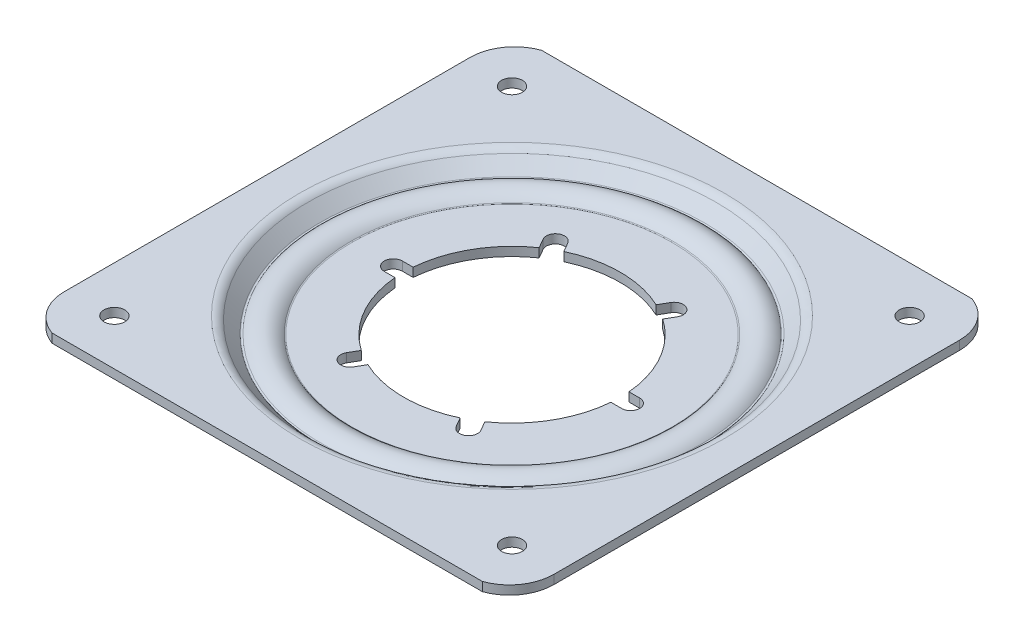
ISO-10303-21;
HEADER;
FILE_DESCRIPTION(('STEP AP214'),'2;1');
FILE_NAME('part.step','',(''),(''),'','','');
FILE_SCHEMA(('AUTOMOTIVE_DESIGN { 1 0 10303 214 1 1 1 1 }'));
ENDSEC;
DATA;
#1=APPLICATION_CONTEXT('core data for automotive mechanical design processes');
#2=APPLICATION_PROTOCOL_DEFINITION('international standard','automotive_design',2000,#1);
#3=PRODUCT_CONTEXT('',#1,'mechanical');
#4=PRODUCT('Part','Part','',(#3));
#5=PRODUCT_RELATED_PRODUCT_CATEGORY('part','',(#4));
#6=PRODUCT_DEFINITION_FORMATION('','',#4);
#7=PRODUCT_DEFINITION_CONTEXT('part definition',#1,'design');
#8=PRODUCT_DEFINITION('design','',#6,#7);
#9=PRODUCT_DEFINITION_SHAPE('','',#8);
#10=(LENGTH_UNIT() NAMED_UNIT(*) SI_UNIT(.MILLI.,.METRE.));
#11=(NAMED_UNIT(*) PLANE_ANGLE_UNIT() SI_UNIT($,.RADIAN.));
#12=(NAMED_UNIT(*) SI_UNIT($,.STERADIAN.) SOLID_ANGLE_UNIT());
#13=UNCERTAINTY_MEASURE_WITH_UNIT(LENGTH_MEASURE(1.E-05),#10,'distance_accuracy_value','');
#14=(GEOMETRIC_REPRESENTATION_CONTEXT(3) GLOBAL_UNCERTAINTY_ASSIGNED_CONTEXT((#13)) GLOBAL_UNIT_ASSIGNED_CONTEXT((#10,
#11,#12)) REPRESENTATION_CONTEXT('',''));
#15=CARTESIAN_POINT('',(0.,0.,0.));
#16=DIRECTION('',(0.,0.,1.));
#17=DIRECTION('',(1.,0.,0.));
#18=AXIS2_PLACEMENT_3D('',#15,#16,#17);
#19=CARTESIAN_POINT('',(-23.0389525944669,5.60000000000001,3.04999999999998));
#20=DIRECTION('',(0.,0.,1.));
#21=DIRECTION('',(-1.,0.,0.));
#22=AXIS2_PLACEMENT_3D('',#19,#20,#21);
#23=PLANE('',#22);
#24=DIRECTION('',(0.,1.,0.));
#25=VECTOR('',#24,1.);
#26=CARTESIAN_POINT('',(-36.3723452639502,8.60000000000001,3.04999999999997));
#27=LINE('',#26,#25);
#28=CARTESIAN_POINT('',(-36.3723452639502,13.1,3.04999999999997));
#29=VERTEX_POINT('',#28);
#30=CARTESIAN_POINT('',(-36.3723452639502,10.1,3.04999999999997));
#31=VERTEX_POINT('',#30);
#32=EDGE_CURVE('E243',#29,#31,#27,.F.);
#33=ORIENTED_EDGE('',*,*,#32,.T.);
#34=DIRECTION('',(-1.,0.,0.));
#35=VECTOR('',#34,1.);
#36=CARTESIAN_POINT('',(0.,10.1,3.04999999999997));
#37=LINE('',#36,#35);
#38=CARTESIAN_POINT('',(-40.,10.1,3.04999999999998));
#39=VERTEX_POINT('',#38);
#40=EDGE_CURVE('E273',#39,#31,#37,.F.);
#41=ORIENTED_EDGE('',*,*,#40,.F.);
#42=DIRECTION('',(0.,1.,0.));
#43=VECTOR('',#42,1.);
#44=CARTESIAN_POINT('',(-40.,5.60000000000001,3.04999999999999));
#45=LINE('',#44,#43);
#46=CARTESIAN_POINT('',(-40.,13.1,3.04999999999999));
#47=VERTEX_POINT('',#46);
#48=EDGE_CURVE('E651',#39,#47,#45,.T.);
#49=ORIENTED_EDGE('',*,*,#48,.T.);
#50=DIRECTION('',(-1.,0.,0.));
#51=VECTOR('',#50,1.);
#52=CARTESIAN_POINT('',(0.,13.1,3.04999999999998));
#53=LINE('',#52,#51);
#54=EDGE_CURVE('E525',#29,#47,#53,.T.);
#55=ORIENTED_EDGE('',*,*,#54,.F.);
#56=EDGE_LOOP('',(#33,#41,#49,#55));
#57=FACE_BOUND('',#56,.T.);
#58=ADVANCED_FACE('F15',(#57),#23,.F.);
#59=CARTESIAN_POINT('',(-40.,5.60000000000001,0.));
#60=DIRECTION('',(0.,1.,0.));
#61=DIRECTION('',(0.,0.,-1.));
#62=AXIS2_PLACEMENT_3D('',#59,#60,#61);
#63=CYLINDRICAL_SURFACE('',#62,3.05);
#64=ORIENTED_EDGE('',*,*,#48,.F.);
#65=CARTESIAN_POINT('',(-40.,10.1,0.));
#66=DIRECTION('',(0.,1.,0.));
#67=DIRECTION('',(0.,0.,-1.));
#68=AXIS2_PLACEMENT_3D('',#65,#66,#67);
#69=CIRCLE('',#68,3.05);
#70=CARTESIAN_POINT('',(-40.,10.1,-3.05000000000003));
#71=VERTEX_POINT('',#70);
#72=EDGE_CURVE('E528',#71,#39,#69,.T.);
#73=ORIENTED_EDGE('',*,*,#72,.F.);
#74=DIRECTION('',(0.,-1.,0.));
#75=VECTOR('',#74,1.);
#76=CARTESIAN_POINT('',(-40.,5.60000000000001,-3.05000000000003));
#77=LINE('',#76,#75);
#78=CARTESIAN_POINT('',(-40.,13.1,-3.05000000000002));
#79=VERTEX_POINT('',#78);
#80=EDGE_CURVE('E649',#71,#79,#77,.F.);
#81=ORIENTED_EDGE('',*,*,#80,.T.);
#82=CARTESIAN_POINT('',(-40.,13.1,0.));
#83=DIRECTION('',(0.,1.,0.));
#84=DIRECTION('',(0.,0.,-1.));
#85=AXIS2_PLACEMENT_3D('',#82,#83,#84);
#86=CIRCLE('',#85,3.05);
#87=EDGE_CURVE('E524',#47,#79,#86,.F.);
#88=ORIENTED_EDGE('',*,*,#87,.F.);
#89=EDGE_LOOP('',(#64,#73,#81,#88));
#90=FACE_BOUND('',#89,.T.);
#91=ADVANCED_FACE('F808',(#90),#63,.F.);
#92=CARTESIAN_POINT('',(-40.,5.60000000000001,-3.05000000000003));
#93=DIRECTION('',(0.,0.,-1.));
#94=DIRECTION('',(1.,0.,0.));
#95=AXIS2_PLACEMENT_3D('',#92,#93,#94);
#96=PLANE('',#95);
#97=ORIENTED_EDGE('',*,*,#80,.F.);
#98=DIRECTION('',(-1.,0.,0.));
#99=VECTOR('',#98,1.);
#100=CARTESIAN_POINT('',(0.,10.1,-3.05000000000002));
#101=LINE('',#100,#99);
#102=CARTESIAN_POINT('',(-36.3723452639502,10.1,-3.05000000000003));
#103=VERTEX_POINT('',#102);
#104=EDGE_CURVE('E553',#103,#71,#101,.T.);
#105=ORIENTED_EDGE('',*,*,#104,.F.);
#106=DIRECTION('',(0.,1.,0.));
#107=VECTOR('',#106,1.);
#108=CARTESIAN_POINT('',(-36.3723452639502,8.60000000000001,-3.05000000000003));
#109=LINE('',#108,#107);
#110=CARTESIAN_POINT('',(-36.3723452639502,13.1,-3.05000000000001));
#111=VERTEX_POINT('',#110);
#112=EDGE_CURVE('E647',#103,#111,#109,.T.);
#113=ORIENTED_EDGE('',*,*,#112,.T.);
#114=DIRECTION('',(-1.,0.,0.));
#115=VECTOR('',#114,1.);
#116=CARTESIAN_POINT('',(0.,13.1,-3.05));
#117=LINE('',#116,#115);
#118=EDGE_CURVE('E521',#79,#111,#117,.F.);
#119=ORIENTED_EDGE('',*,*,#118,.F.);
#120=EDGE_LOOP('',(#97,#105,#113,#119));
#121=FACE_BOUND('',#120,.T.);
#122=ADVANCED_FACE('F804',(#121),#96,.F.);
#123=CARTESIAN_POINT('',(0.,8.60000000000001,0.));
#124=DIRECTION('',(0.,1.,0.));
#125=DIRECTION('',(0.,0.,-1.));
#126=AXIS2_PLACEMENT_3D('',#123,#124,#125);
#127=CYLINDRICAL_SURFACE('',#126,36.5);
#128=ORIENTED_EDGE('',*,*,#112,.F.);
#129=CARTESIAN_POINT('',(0.,10.1,0.));
#130=DIRECTION('',(0.,1.,0.));
#131=DIRECTION('',(0.,0.,-1.));
#132=AXIS2_PLACEMENT_3D('',#129,#130,#131);
#133=CIRCLE('',#132,36.5);
#134=CARTESIAN_POINT('',(-20.8275501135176,10.1,-29.9743749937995));
#135=VERTEX_POINT('',#134);
#136=EDGE_CURVE('E560',#135,#103,#133,.T.);
#137=ORIENTED_EDGE('',*,*,#136,.F.);
#138=DIRECTION('',(0.,-1.,0.));
#139=VECTOR('',#138,1.);
#140=CARTESIAN_POINT('',(-20.8275501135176,5.60000000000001,-29.9743749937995));
#141=LINE('',#140,#139);
#142=CARTESIAN_POINT('',(-20.8275501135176,13.1,-29.9743749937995));
#143=VERTEX_POINT('',#142);
#144=EDGE_CURVE('E645',#135,#143,#141,.F.);
#145=ORIENTED_EDGE('',*,*,#144,.T.);
#146=CARTESIAN_POINT('',(0.,13.1,0.));
#147=DIRECTION('',(0.,1.,0.));
#148=DIRECTION('',(0.,0.,-1.));
#149=AXIS2_PLACEMENT_3D('',#146,#147,#148);
#150=CIRCLE('',#149,36.5);
#151=EDGE_CURVE('E520',#111,#143,#150,.F.);
#152=ORIENTED_EDGE('',*,*,#151,.F.);
#153=EDGE_LOOP('',(#128,#137,#145,#152));
#154=FACE_BOUND('',#153,.T.);
#155=ADVANCED_FACE('F800',(#154),#127,.F.);
#156=CARTESIAN_POINT('',(-14.160853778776,5.60000000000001,-18.4273182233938));
#157=DIRECTION('',(-0.866025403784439,0.,0.499999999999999));
#158=DIRECTION('',(-0.499999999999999,0.,-0.866025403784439));
#159=AXIS2_PLACEMENT_3D('',#156,#157,#158);
#160=PLANE('',#159);
#161=ORIENTED_EDGE('',*,*,#144,.F.);
#162=DIRECTION('',(0.499999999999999,0.,0.866025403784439));
#163=VECTOR('',#162,1.);
#164=CARTESIAN_POINT('',(-22.6413774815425,10.1,-33.1160161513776));
#165=LINE('',#164,#163);
#166=CARTESIAN_POINT('',(-22.6413774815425,10.1,-33.1160161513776));
#167=VERTEX_POINT('',#166);
#168=EDGE_CURVE('E561',#167,#135,#165,.T.);
#169=ORIENTED_EDGE('',*,*,#168,.F.);
#170=DIRECTION('',(0.,1.,0.));
#171=VECTOR('',#170,1.);
#172=CARTESIAN_POINT('',(-22.6413774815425,5.60000000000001,-33.1160161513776));
#173=LINE('',#172,#171);
#174=CARTESIAN_POINT('',(-22.6413774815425,13.1,-33.1160161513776));
#175=VERTEX_POINT('',#174);
#176=EDGE_CURVE('E642',#167,#175,#173,.T.);
#177=ORIENTED_EDGE('',*,*,#176,.T.);
#178=DIRECTION('',(-0.499999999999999,0.,-0.866025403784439));
#179=VECTOR('',#178,1.);
#180=CARTESIAN_POINT('',(-20.8275501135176,13.1,-29.9743749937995));
#181=LINE('',#180,#179);
#182=EDGE_CURVE('E517',#143,#175,#181,.T.);
#183=ORIENTED_EDGE('',*,*,#182,.F.);
#184=EDGE_LOOP('',(#161,#169,#177,#183));
#185=FACE_BOUND('',#184,.T.);
#186=ADVANCED_FACE('F796',(#185),#160,.F.);
#187=CARTESIAN_POINT('',(-20.,5.60000000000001,-34.6410161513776));
#188=DIRECTION('',(0.,1.,0.));
#189=DIRECTION('',(0.,0.,-1.));
#190=AXIS2_PLACEMENT_3D('',#187,#188,#189);
#191=CYLINDRICAL_SURFACE('',#190,3.05);
#192=CARTESIAN_POINT('',(-20.,10.1,-34.6410161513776));
#193=DIRECTION('',(0.,1.,0.));
#194=DIRECTION('',(0.,0.,-1.));
#195=AXIS2_PLACEMENT_3D('',#192,#193,#194);
#196=CIRCLE('',#195,3.05);
#197=CARTESIAN_POINT('',(-17.3586225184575,10.1,-36.1660161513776));
#198=VERTEX_POINT('',#197);
#199=EDGE_CURVE('E564',#198,#167,#196,.T.);
#200=ORIENTED_EDGE('',*,*,#199,.F.);
#201=DIRECTION('',(0.,-1.,0.));
#202=VECTOR('',#201,1.);
#203=CARTESIAN_POINT('',(-17.3586225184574,5.60000000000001,-36.1660161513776));
#204=LINE('',#203,#202);
#205=CARTESIAN_POINT('',(-17.3586225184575,13.1,-36.1660161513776));
#206=VERTEX_POINT('',#205);
#207=EDGE_CURVE('E640',#198,#206,#204,.F.);
#208=ORIENTED_EDGE('',*,*,#207,.T.);
#209=CARTESIAN_POINT('',(-20.,13.1,-34.6410161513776));
#210=DIRECTION('',(0.,1.,0.));
#211=DIRECTION('',(0.,0.,-1.));
#212=AXIS2_PLACEMENT_3D('',#209,#210,#211);
#213=CIRCLE('',#212,3.05);
#214=EDGE_CURVE('E516',#175,#206,#213,.F.);
#215=ORIENTED_EDGE('',*,*,#214,.F.);
#216=ORIENTED_EDGE('',*,*,#176,.F.);
#217=EDGE_LOOP('',(#200,#208,#215,#216));
#218=FACE_BOUND('',#217,.T.);
#219=ADVANCED_FACE('F792',(#218),#191,.F.);
#220=CARTESIAN_POINT('',(-17.3586225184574,5.60000000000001,-36.1660161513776));
#221=DIRECTION('',(0.866025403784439,0.,-0.5));
#222=DIRECTION('',(0.5,0.,0.866025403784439));
#223=AXIS2_PLACEMENT_3D('',#220,#221,#222);
#224=PLANE('',#223);
#225=ORIENTED_EDGE('',*,*,#207,.F.);
#226=DIRECTION('',(-0.500000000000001,0.,-0.866025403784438));
#227=VECTOR('',#226,1.);
#228=CARTESIAN_POINT('',(-15.5447951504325,10.1,-33.0243749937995));
#229=LINE('',#228,#227);
#230=CARTESIAN_POINT('',(-15.5447951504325,10.1,-33.0243749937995));
#231=VERTEX_POINT('',#230);
#232=EDGE_CURVE('E565',#231,#198,#229,.T.);
#233=ORIENTED_EDGE('',*,*,#232,.F.);
#234=DIRECTION('',(0.,1.,0.));
#235=VECTOR('',#234,1.);
#236=CARTESIAN_POINT('',(-15.5447951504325,8.60000000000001,-33.0243749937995));
#237=LINE('',#236,#235);
#238=CARTESIAN_POINT('',(-15.5447951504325,13.1,-33.0243749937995));
#239=VERTEX_POINT('',#238);
#240=EDGE_CURVE('E637',#231,#239,#237,.T.);
#241=ORIENTED_EDGE('',*,*,#240,.T.);
#242=DIRECTION('',(0.500000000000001,0.,0.866025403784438));
#243=VECTOR('',#242,1.);
#244=CARTESIAN_POINT('',(-17.3586225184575,13.1,-36.1660161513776));
#245=LINE('',#244,#243);
#246=EDGE_CURVE('E513',#206,#239,#245,.T.);
#247=ORIENTED_EDGE('',*,*,#246,.F.);
#248=EDGE_LOOP('',(#225,#233,#241,#247));
#249=FACE_BOUND('',#248,.T.);
#250=ADVANCED_FACE('F790',(#249),#224,.F.);
#251=CARTESIAN_POINT('',(0.,8.60000000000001,0.));
#252=DIRECTION('',(0.,1.,0.));
#253=DIRECTION('',(0.,0.,-1.));
#254=AXIS2_PLACEMENT_3D('',#251,#252,#253);
#255=CYLINDRICAL_SURFACE('',#254,36.5);
#256=CARTESIAN_POINT('',(0.,10.1,0.));
#257=DIRECTION('',(0.,1.,0.));
#258=DIRECTION('',(0.,0.,-1.));
#259=AXIS2_PLACEMENT_3D('',#256,#257,#258);
#260=CIRCLE('',#259,36.5);
#261=CARTESIAN_POINT('',(15.5447951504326,10.1,-33.0243749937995));
#262=VERTEX_POINT('',#261);
#263=EDGE_CURVE('E568',#262,#231,#260,.T.);
#264=ORIENTED_EDGE('',*,*,#263,.F.);
#265=DIRECTION('',(0.,-1.,0.));
#266=VECTOR('',#265,1.);
#267=CARTESIAN_POINT('',(15.5447951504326,5.60000000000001,-33.0243749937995));
#268=LINE('',#267,#266);
#269=CARTESIAN_POINT('',(15.5447951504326,13.1,-33.0243749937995));
#270=VERTEX_POINT('',#269);
#271=EDGE_CURVE('E635',#262,#270,#268,.F.);
#272=ORIENTED_EDGE('',*,*,#271,.T.);
#273=CARTESIAN_POINT('',(0.,13.1,0.));
#274=DIRECTION('',(0.,1.,0.));
#275=DIRECTION('',(0.,0.,-1.));
#276=AXIS2_PLACEMENT_3D('',#273,#274,#275);
#277=CIRCLE('',#276,36.5);
#278=EDGE_CURVE('E512',#239,#270,#277,.F.);
#279=ORIENTED_EDGE('',*,*,#278,.F.);
#280=ORIENTED_EDGE('',*,*,#240,.F.);
#281=EDGE_LOOP('',(#264,#272,#279,#280));
#282=FACE_BOUND('',#281,.T.);
#283=ADVANCED_FACE('F786',(#282),#255,.F.);
#284=CARTESIAN_POINT('',(8.87809881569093,5.60000000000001,-21.4773182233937));
#285=DIRECTION('',(-0.866025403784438,0.,-0.500000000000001));
#286=DIRECTION('',(0.500000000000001,0.,-0.866025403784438));
#287=AXIS2_PLACEMENT_3D('',#284,#285,#286);
#288=PLANE('',#287);
#289=ORIENTED_EDGE('',*,*,#271,.F.);
#290=DIRECTION('',(-0.5,0.,0.866025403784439));
#291=VECTOR('',#290,1.);
#292=CARTESIAN_POINT('',(17.3586225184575,10.1,-36.1660161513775));
#293=LINE('',#292,#291);
#294=CARTESIAN_POINT('',(17.3586225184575,10.1,-36.1660161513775));
#295=VERTEX_POINT('',#294);
#296=EDGE_CURVE('E569',#295,#262,#293,.T.);
#297=ORIENTED_EDGE('',*,*,#296,.F.);
#298=DIRECTION('',(0.,1.,0.));
#299=VECTOR('',#298,1.);
#300=CARTESIAN_POINT('',(17.3586225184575,5.60000000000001,-36.1660161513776));
#301=LINE('',#300,#299);
#302=CARTESIAN_POINT('',(17.3586225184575,13.1,-36.1660161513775));
#303=VERTEX_POINT('',#302);
#304=EDGE_CURVE('E632',#295,#303,#301,.T.);
#305=ORIENTED_EDGE('',*,*,#304,.T.);
#306=DIRECTION('',(0.5,0.,-0.866025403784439));
#307=VECTOR('',#306,1.);
#308=CARTESIAN_POINT('',(15.5447951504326,13.1,-33.0243749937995));
#309=LINE('',#308,#307);
#310=EDGE_CURVE('E509',#270,#303,#309,.T.);
#311=ORIENTED_EDGE('',*,*,#310,.F.);
#312=EDGE_LOOP('',(#289,#297,#305,#311));
#313=FACE_BOUND('',#312,.T.);
#314=ADVANCED_FACE('F783',(#313),#288,.F.);
#315=CARTESIAN_POINT('',(20.,5.60000000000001,-34.6410161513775));
#316=DIRECTION('',(0.,1.,0.));
#317=DIRECTION('',(0.,0.,-1.));
#318=AXIS2_PLACEMENT_3D('',#315,#316,#317);
#319=CYLINDRICAL_SURFACE('',#318,3.05);
#320=CARTESIAN_POINT('',(20.,10.1,-34.6410161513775));
#321=DIRECTION('',(0.,1.,0.));
#322=DIRECTION('',(0.,0.,-1.));
#323=AXIS2_PLACEMENT_3D('',#320,#321,#322);
#324=CIRCLE('',#323,3.05);
#325=CARTESIAN_POINT('',(22.6413774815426,10.1,-33.1160161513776));
#326=VERTEX_POINT('',#325);
#327=EDGE_CURVE('E572',#326,#295,#324,.T.);
#328=ORIENTED_EDGE('',*,*,#327,.F.);
#329=DIRECTION('',(0.,-1.,0.));
#330=VECTOR('',#329,1.);
#331=CARTESIAN_POINT('',(22.6413774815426,5.60000000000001,-33.1160161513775));
#332=LINE('',#331,#330);
#333=CARTESIAN_POINT('',(22.6413774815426,13.1,-33.1160161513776));
#334=VERTEX_POINT('',#333);
#335=EDGE_CURVE('E630',#326,#334,#332,.F.);
#336=ORIENTED_EDGE('',*,*,#335,.T.);
#337=CARTESIAN_POINT('',(20.,13.1,-34.6410161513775));
#338=DIRECTION('',(0.,1.,0.));
#339=DIRECTION('',(0.,0.,-1.));
#340=AXIS2_PLACEMENT_3D('',#337,#338,#339);
#341=CIRCLE('',#340,3.05);
#342=EDGE_CURVE('E508',#303,#334,#341,.F.);
#343=ORIENTED_EDGE('',*,*,#342,.F.);
#344=ORIENTED_EDGE('',*,*,#304,.F.);
#345=EDGE_LOOP('',(#328,#336,#343,#344));
#346=FACE_BOUND('',#345,.T.);
#347=ADVANCED_FACE('F778',(#346),#319,.F.);
#348=CARTESIAN_POINT('',(22.6413774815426,5.60000000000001,-33.1160161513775));
#349=DIRECTION('',(0.866025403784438,0.,0.5));
#350=DIRECTION('',(-0.5,0.,0.866025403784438));
#351=AXIS2_PLACEMENT_3D('',#348,#349,#350);
#352=PLANE('',#351);
#353=ORIENTED_EDGE('',*,*,#335,.F.);
#354=DIRECTION('',(0.499999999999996,0.,-0.866025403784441));
#355=VECTOR('',#354,1.);
#356=CARTESIAN_POINT('',(20.8275501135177,10.1,-29.9743749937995));
#357=LINE('',#356,#355);
#358=CARTESIAN_POINT('',(20.8275501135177,10.1,-29.9743749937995));
#359=VERTEX_POINT('',#358);
#360=EDGE_CURVE('E573',#359,#326,#357,.T.);
#361=ORIENTED_EDGE('',*,*,#360,.F.);
#362=DIRECTION('',(0.,1.,0.));
#363=VECTOR('',#362,1.);
#364=CARTESIAN_POINT('',(20.8275501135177,8.60000000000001,-29.9743749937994));
#365=LINE('',#364,#363);
#366=CARTESIAN_POINT('',(20.8275501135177,13.1,-29.9743749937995));
#367=VERTEX_POINT('',#366);
#368=EDGE_CURVE('E628',#359,#367,#365,.T.);
#369=ORIENTED_EDGE('',*,*,#368,.T.);
#370=DIRECTION('',(-0.499999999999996,0.,0.866025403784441));
#371=VECTOR('',#370,1.);
#372=CARTESIAN_POINT('',(22.6413774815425,13.1,-33.1160161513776));
#373=LINE('',#372,#371);
#374=EDGE_CURVE('E505',#334,#367,#373,.T.);
#375=ORIENTED_EDGE('',*,*,#374,.F.);
#376=EDGE_LOOP('',(#353,#361,#369,#375));
#377=FACE_BOUND('',#376,.T.);
#378=ADVANCED_FACE('F775',(#377),#352,.F.);
#379=CARTESIAN_POINT('',(0.,8.60000000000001,0.));
#380=DIRECTION('',(0.,1.,0.));
#381=DIRECTION('',(0.,0.,-1.));
#382=AXIS2_PLACEMENT_3D('',#379,#380,#381);
#383=CYLINDRICAL_SURFACE('',#382,36.5);
#384=ORIENTED_EDGE('',*,*,#368,.F.);
#385=CARTESIAN_POINT('',(0.,10.1,0.));
#386=DIRECTION('',(0.,1.,0.));
#387=DIRECTION('',(0.,0.,-1.));
#388=AXIS2_PLACEMENT_3D('',#385,#386,#387);
#389=CIRCLE('',#388,36.5);
#390=CARTESIAN_POINT('',(36.3723452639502,10.1,-3.04999999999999));
#391=VERTEX_POINT('',#390);
#392=EDGE_CURVE('E576',#391,#359,#389,.T.);
#393=ORIENTED_EDGE('',*,*,#392,.F.);
#394=DIRECTION('',(0.,-1.,0.));
#395=VECTOR('',#394,1.);
#396=CARTESIAN_POINT('',(36.3723452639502,5.60000000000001,-3.04999999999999));
#397=LINE('',#396,#395);
#398=CARTESIAN_POINT('',(36.3723452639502,13.1,-3.04999999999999));
#399=VERTEX_POINT('',#398);
#400=EDGE_CURVE('E626',#391,#399,#397,.F.);
#401=ORIENTED_EDGE('',*,*,#400,.T.);
#402=CARTESIAN_POINT('',(0.,13.1,0.));
#403=DIRECTION('',(0.,1.,0.));
#404=DIRECTION('',(0.,0.,-1.));
#405=AXIS2_PLACEMENT_3D('',#402,#403,#404);
#406=CIRCLE('',#405,36.5);
#407=EDGE_CURVE('E504',#367,#399,#406,.F.);
#408=ORIENTED_EDGE('',*,*,#407,.F.);
#409=EDGE_LOOP('',(#384,#393,#401,#408));
#410=FACE_BOUND('',#409,.T.);
#411=ADVANCED_FACE('F771',(#410),#383,.F.);
#412=CARTESIAN_POINT('',(23.0389525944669,5.60000000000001,-3.04999999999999));
#413=DIRECTION('',(0.,0.,-1.));
#414=DIRECTION('',(1.,0.,0.));
#415=AXIS2_PLACEMENT_3D('',#412,#413,#414);
#416=PLANE('',#415);
#417=ORIENTED_EDGE('',*,*,#400,.F.);
#418=DIRECTION('',(-1.,0.,0.));
#419=VECTOR('',#418,1.);
#420=CARTESIAN_POINT('',(0.,10.1,-3.04999999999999));
#421=LINE('',#420,#419);
#422=CARTESIAN_POINT('',(40.,10.1,-3.05));
#423=VERTEX_POINT('',#422);
#424=EDGE_CURVE('E577',#423,#391,#421,.T.);
#425=ORIENTED_EDGE('',*,*,#424,.F.);
#426=DIRECTION('',(0.,1.,0.));
#427=VECTOR('',#426,1.);
#428=CARTESIAN_POINT('',(40.,5.60000000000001,-3.05));
#429=LINE('',#428,#427);
#430=CARTESIAN_POINT('',(40.,13.1,-3.05));
#431=VERTEX_POINT('',#430);
#432=EDGE_CURVE('E624',#423,#431,#429,.T.);
#433=ORIENTED_EDGE('',*,*,#432,.T.);
#434=DIRECTION('',(-1.,0.,0.));
#435=VECTOR('',#434,1.);
#436=CARTESIAN_POINT('',(0.,13.1,-3.04999999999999));
#437=LINE('',#436,#435);
#438=EDGE_CURVE('E501',#399,#431,#437,.F.);
#439=ORIENTED_EDGE('',*,*,#438,.F.);
#440=EDGE_LOOP('',(#417,#425,#433,#439));
#441=FACE_BOUND('',#440,.T.);
#442=ADVANCED_FACE('F767',(#441),#416,.F.);
#443=CARTESIAN_POINT('',(40.,5.60000000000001,0.));
#444=DIRECTION('',(0.,1.,0.));
#445=DIRECTION('',(0.,0.,-1.));
#446=AXIS2_PLACEMENT_3D('',#443,#444,#445);
#447=CYLINDRICAL_SURFACE('',#446,3.05);
#448=ORIENTED_EDGE('',*,*,#432,.F.);
#449=CARTESIAN_POINT('',(40.,10.1,0.));
#450=DIRECTION('',(0.,1.,0.));
#451=DIRECTION('',(0.,0.,-1.));
#452=AXIS2_PLACEMENT_3D('',#449,#450,#451);
#453=CIRCLE('',#452,3.05);
#454=CARTESIAN_POINT('',(40.,10.1,3.05000000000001));
#455=VERTEX_POINT('',#454);
#456=EDGE_CURVE('E580',#455,#423,#453,.T.);
#457=ORIENTED_EDGE('',*,*,#456,.F.);
#458=DIRECTION('',(0.,-1.,0.));
#459=VECTOR('',#458,1.);
#460=CARTESIAN_POINT('',(40.,5.60000000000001,3.05000000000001));
#461=LINE('',#460,#459);
#462=CARTESIAN_POINT('',(40.,13.1,3.05));
#463=VERTEX_POINT('',#462);
#464=EDGE_CURVE('E622',#455,#463,#461,.F.);
#465=ORIENTED_EDGE('',*,*,#464,.T.);
#466=CARTESIAN_POINT('',(40.,13.1,0.));
#467=DIRECTION('',(0.,1.,0.));
#468=DIRECTION('',(0.,0.,-1.));
#469=AXIS2_PLACEMENT_3D('',#466,#467,#468);
#470=CIRCLE('',#469,3.05);
#471=EDGE_CURVE('E500',#431,#463,#470,.F.);
#472=ORIENTED_EDGE('',*,*,#471,.F.);
#473=EDGE_LOOP('',(#448,#457,#465,#472));
#474=FACE_BOUND('',#473,.T.);
#475=ADVANCED_FACE('F763',(#474),#447,.F.);
#476=CARTESIAN_POINT('',(40.,5.60000000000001,3.05000000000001));
#477=DIRECTION('',(0.,0.,1.));
#478=DIRECTION('',(-1.,0.,0.));
#479=AXIS2_PLACEMENT_3D('',#476,#477,#478);
#480=PLANE('',#479);
#481=ORIENTED_EDGE('',*,*,#464,.F.);
#482=DIRECTION('',(-1.,0.,0.));
#483=VECTOR('',#482,1.);
#484=CARTESIAN_POINT('',(0.,10.1,3.05000000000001));
#485=LINE('',#484,#483);
#486=CARTESIAN_POINT('',(36.3723452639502,10.1,3.05000000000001));
#487=VERTEX_POINT('',#486);
#488=EDGE_CURVE('E581',#487,#455,#485,.F.);
#489=ORIENTED_EDGE('',*,*,#488,.F.);
#490=DIRECTION('',(0.,1.,0.));
#491=VECTOR('',#490,1.);
#492=CARTESIAN_POINT('',(36.3723452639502,8.60000000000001,3.05000000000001));
#493=LINE('',#492,#491);
#494=CARTESIAN_POINT('',(36.3723452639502,13.1,3.05));
#495=VERTEX_POINT('',#494);
#496=EDGE_CURVE('E620',#487,#495,#493,.T.);
#497=ORIENTED_EDGE('',*,*,#496,.T.);
#498=DIRECTION('',(-1.,0.,0.));
#499=VECTOR('',#498,1.);
#500=CARTESIAN_POINT('',(0.,13.1,3.05));
#501=LINE('',#500,#499);
#502=EDGE_CURVE('E497',#463,#495,#501,.T.);
#503=ORIENTED_EDGE('',*,*,#502,.F.);
#504=EDGE_LOOP('',(#481,#489,#497,#503));
#505=FACE_BOUND('',#504,.T.);
#506=ADVANCED_FACE('F759',(#505),#480,.F.);
#507=CARTESIAN_POINT('',(0.,8.60000000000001,0.));
#508=DIRECTION('',(0.,1.,0.));
#509=DIRECTION('',(0.,0.,-1.));
#510=AXIS2_PLACEMENT_3D('',#507,#508,#509);
#511=CYLINDRICAL_SURFACE('',#510,36.5);
#512=ORIENTED_EDGE('',*,*,#496,.F.);
#513=CARTESIAN_POINT('',(0.,10.1,0.));
#514=DIRECTION('',(0.,1.,0.));
#515=DIRECTION('',(0.,0.,-1.));
#516=AXIS2_PLACEMENT_3D('',#513,#514,#515);
#517=CIRCLE('',#516,36.5);
#518=CARTESIAN_POINT('',(20.8275501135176,10.1,29.9743749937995));
#519=VERTEX_POINT('',#518);
#520=EDGE_CURVE('E584',#519,#487,#517,.T.);
#521=ORIENTED_EDGE('',*,*,#520,.F.);
#522=DIRECTION('',(0.,-1.,0.));
#523=VECTOR('',#522,1.);
#524=CARTESIAN_POINT('',(20.8275501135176,5.60000000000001,29.9743749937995));
#525=LINE('',#524,#523);
#526=CARTESIAN_POINT('',(20.8275501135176,13.1,29.9743749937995));
#527=VERTEX_POINT('',#526);
#528=EDGE_CURVE('E618',#519,#527,#525,.F.);
#529=ORIENTED_EDGE('',*,*,#528,.T.);
#530=CARTESIAN_POINT('',(0.,13.1,0.));
#531=DIRECTION('',(0.,1.,0.));
#532=DIRECTION('',(0.,0.,-1.));
#533=AXIS2_PLACEMENT_3D('',#530,#531,#532);
#534=CIRCLE('',#533,36.5);
#535=EDGE_CURVE('E496',#495,#527,#534,.F.);
#536=ORIENTED_EDGE('',*,*,#535,.F.);
#537=EDGE_LOOP('',(#512,#521,#529,#536));
#538=FACE_BOUND('',#537,.T.);
#539=ADVANCED_FACE('F755',(#538),#511,.F.);
#540=CARTESIAN_POINT('',(14.160853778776,5.60000000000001,18.4273182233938));
#541=DIRECTION('',(0.866025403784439,0.,-0.5));
#542=DIRECTION('',(0.5,0.,0.866025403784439));
#543=AXIS2_PLACEMENT_3D('',#540,#541,#542);
#544=PLANE('',#543);
#545=ORIENTED_EDGE('',*,*,#528,.F.);
#546=DIRECTION('',(-0.499999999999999,0.,-0.866025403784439));
#547=VECTOR('',#546,1.);
#548=CARTESIAN_POINT('',(22.6413774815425,10.1,33.1160161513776));
#549=LINE('',#548,#547);
#550=CARTESIAN_POINT('',(22.6413774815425,10.1,33.1160161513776));
#551=VERTEX_POINT('',#550);
#552=EDGE_CURVE('E585',#551,#519,#549,.T.);
#553=ORIENTED_EDGE('',*,*,#552,.F.);
#554=DIRECTION('',(0.,1.,0.));
#555=VECTOR('',#554,1.);
#556=CARTESIAN_POINT('',(22.6413774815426,5.60000000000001,33.1160161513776));
#557=LINE('',#556,#555);
#558=CARTESIAN_POINT('',(22.6413774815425,13.1,33.1160161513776));
#559=VERTEX_POINT('',#558);
#560=EDGE_CURVE('E616',#551,#559,#557,.T.);
#561=ORIENTED_EDGE('',*,*,#560,.T.);
#562=DIRECTION('',(0.499999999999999,0.,0.866025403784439));
#563=VECTOR('',#562,1.);
#564=CARTESIAN_POINT('',(20.8275501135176,13.1,29.9743749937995));
#565=LINE('',#564,#563);
#566=EDGE_CURVE('E493',#527,#559,#565,.T.);
#567=ORIENTED_EDGE('',*,*,#566,.F.);
#568=EDGE_LOOP('',(#545,#553,#561,#567));
#569=FACE_BOUND('',#568,.T.);
#570=ADVANCED_FACE('F751',(#569),#544,.F.);
#571=CARTESIAN_POINT('',(20.,5.60000000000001,34.6410161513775));
#572=DIRECTION('',(0.,1.,0.));
#573=DIRECTION('',(0.,0.,-1.));
#574=AXIS2_PLACEMENT_3D('',#571,#572,#573);
#575=CYLINDRICAL_SURFACE('',#574,3.05);
#576=ORIENTED_EDGE('',*,*,#560,.F.);
#577=CARTESIAN_POINT('',(20.,10.1,34.6410161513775));
#578=DIRECTION('',(0.,1.,0.));
#579=DIRECTION('',(0.,0.,-1.));
#580=AXIS2_PLACEMENT_3D('',#577,#578,#579);
#581=CIRCLE('',#580,3.05);
#582=CARTESIAN_POINT('',(17.3586225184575,10.1,36.1660161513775));
#583=VERTEX_POINT('',#582);
#584=EDGE_CURVE('E588',#583,#551,#581,.T.);
#585=ORIENTED_EDGE('',*,*,#584,.F.);
#586=DIRECTION('',(0.,-1.,0.));
#587=VECTOR('',#586,1.);
#588=CARTESIAN_POINT('',(17.3586225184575,5.60000000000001,36.1660161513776));
#589=LINE('',#588,#587);
#590=CARTESIAN_POINT('',(17.3586225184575,13.1,36.1660161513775));
#591=VERTEX_POINT('',#590);
#592=EDGE_CURVE('E614',#583,#591,#589,.F.);
#593=ORIENTED_EDGE('',*,*,#592,.T.);
#594=CARTESIAN_POINT('',(20.,13.1,34.6410161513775));
#595=DIRECTION('',(0.,1.,0.));
#596=DIRECTION('',(0.,0.,-1.));
#597=AXIS2_PLACEMENT_3D('',#594,#595,#596);
#598=CIRCLE('',#597,3.05);
#599=EDGE_CURVE('E492',#559,#591,#598,.F.);
#600=ORIENTED_EDGE('',*,*,#599,.F.);
#601=EDGE_LOOP('',(#576,#585,#593,#600));
#602=FACE_BOUND('',#601,.T.);
#603=ADVANCED_FACE('F747',(#602),#575,.F.);
#604=CARTESIAN_POINT('',(17.3586225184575,5.60000000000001,36.1660161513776));
#605=DIRECTION('',(-0.866025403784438,0.,0.5));
#606=DIRECTION('',(-0.5,0.,-0.866025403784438));
#607=AXIS2_PLACEMENT_3D('',#604,#605,#606);
#608=PLANE('',#607);
#609=ORIENTED_EDGE('',*,*,#592,.F.);
#610=DIRECTION('',(0.500000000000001,0.,0.866025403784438));
#611=VECTOR('',#610,1.);
#612=CARTESIAN_POINT('',(15.5447951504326,10.1,33.0243749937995));
#613=LINE('',#612,#611);
#614=CARTESIAN_POINT('',(15.5447951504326,10.1,33.0243749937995));
#615=VERTEX_POINT('',#614);
#616=EDGE_CURVE('E589',#615,#583,#613,.T.);
#617=ORIENTED_EDGE('',*,*,#616,.F.);
#618=DIRECTION('',(0.,1.,0.));
#619=VECTOR('',#618,1.);
#620=CARTESIAN_POINT('',(15.5447951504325,8.60000000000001,33.0243749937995));
#621=LINE('',#620,#619);
#622=CARTESIAN_POINT('',(15.5447951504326,13.1,33.0243749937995));
#623=VERTEX_POINT('',#622);
#624=EDGE_CURVE('E612',#615,#623,#621,.T.);
#625=ORIENTED_EDGE('',*,*,#624,.T.);
#626=DIRECTION('',(-0.500000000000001,0.,-0.866025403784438));
#627=VECTOR('',#626,1.);
#628=CARTESIAN_POINT('',(17.3586225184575,13.1,36.1660161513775));
#629=LINE('',#628,#627);
#630=EDGE_CURVE('E489',#591,#623,#629,.T.);
#631=ORIENTED_EDGE('',*,*,#630,.F.);
#632=EDGE_LOOP('',(#609,#617,#625,#631));
#633=FACE_BOUND('',#632,.T.);
#634=ADVANCED_FACE('F743',(#633),#608,.F.);
#635=CARTESIAN_POINT('',(0.,8.60000000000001,0.));
#636=DIRECTION('',(0.,1.,0.));
#637=DIRECTION('',(0.,0.,-1.));
#638=AXIS2_PLACEMENT_3D('',#635,#636,#637);
#639=CYLINDRICAL_SURFACE('',#638,36.5);
#640=ORIENTED_EDGE('',*,*,#624,.F.);
#641=CARTESIAN_POINT('',(0.,10.1,0.));
#642=DIRECTION('',(0.,1.,0.));
#643=DIRECTION('',(0.,0.,-1.));
#644=AXIS2_PLACEMENT_3D('',#641,#642,#643);
#645=CIRCLE('',#644,36.5);
#646=CARTESIAN_POINT('',(-15.5447951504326,10.1,33.0243749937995));
#647=VERTEX_POINT('',#646);
#648=EDGE_CURVE('E592',#647,#615,#645,.T.);
#649=ORIENTED_EDGE('',*,*,#648,.F.);
#650=DIRECTION('',(0.,-1.,0.));
#651=VECTOR('',#650,1.);
#652=CARTESIAN_POINT('',(-15.5447951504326,5.60000000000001,33.0243749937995));
#653=LINE('',#652,#651);
#654=CARTESIAN_POINT('',(-15.5447951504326,13.1,33.0243749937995));
#655=VERTEX_POINT('',#654);
#656=EDGE_CURVE('E610',#647,#655,#653,.F.);
#657=ORIENTED_EDGE('',*,*,#656,.T.);
#658=CARTESIAN_POINT('',(0.,13.1,0.));
#659=DIRECTION('',(0.,1.,0.));
#660=DIRECTION('',(0.,0.,-1.));
#661=AXIS2_PLACEMENT_3D('',#658,#659,#660);
#662=CIRCLE('',#661,36.5);
#663=EDGE_CURVE('E488',#623,#655,#662,.F.);
#664=ORIENTED_EDGE('',*,*,#663,.F.);
#665=EDGE_LOOP('',(#640,#649,#657,#664));
#666=FACE_BOUND('',#665,.T.);
#667=ADVANCED_FACE('F738',(#666),#639,.F.);
#668=CARTESIAN_POINT('',(-8.87809881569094,5.60000000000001,21.4773182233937));
#669=DIRECTION('',(0.866025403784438,0.,0.500000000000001));
#670=DIRECTION('',(-0.500000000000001,0.,0.866025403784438));
#671=AXIS2_PLACEMENT_3D('',#668,#669,#670);
#672=PLANE('',#671);
#673=ORIENTED_EDGE('',*,*,#656,.F.);
#674=DIRECTION('',(0.5,0.,-0.866025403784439));
#675=VECTOR('',#674,1.);
#676=CARTESIAN_POINT('',(-17.3586225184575,10.1,36.1660161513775));
#677=LINE('',#676,#675);
#678=CARTESIAN_POINT('',(-17.3586225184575,10.1,36.1660161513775));
#679=VERTEX_POINT('',#678);
#680=EDGE_CURVE('E593',#679,#647,#677,.T.);
#681=ORIENTED_EDGE('',*,*,#680,.F.);
#682=DIRECTION('',(0.,1.,0.));
#683=VECTOR('',#682,1.);
#684=CARTESIAN_POINT('',(-17.3586225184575,5.60000000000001,36.1660161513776));
#685=LINE('',#684,#683);
#686=CARTESIAN_POINT('',(-17.3586225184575,13.1,36.1660161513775));
#687=VERTEX_POINT('',#686);
#688=EDGE_CURVE('E608',#679,#687,#685,.T.);
#689=ORIENTED_EDGE('',*,*,#688,.T.);
#690=DIRECTION('',(-0.5,0.,0.866025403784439));
#691=VECTOR('',#690,1.);
#692=CARTESIAN_POINT('',(-15.5447951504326,13.1,33.0243749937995));
#693=LINE('',#692,#691);
#694=EDGE_CURVE('E485',#655,#687,#693,.T.);
#695=ORIENTED_EDGE('',*,*,#694,.F.);
#696=EDGE_LOOP('',(#673,#681,#689,#695));
#697=FACE_BOUND('',#696,.T.);
#698=ADVANCED_FACE('F815',(#697),#672,.F.);
#699=CARTESIAN_POINT('',(-20.,5.60000000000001,34.6410161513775));
#700=DIRECTION('',(0.,1.,0.));
#701=DIRECTION('',(0.,0.,-1.));
#702=AXIS2_PLACEMENT_3D('',#699,#700,#701);
#703=CYLINDRICAL_SURFACE('',#702,3.05);
#704=ORIENTED_EDGE('',*,*,#688,.F.);
#705=CARTESIAN_POINT('',(-20.,10.1,34.6410161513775));
#706=DIRECTION('',(0.,1.,0.));
#707=DIRECTION('',(0.,0.,-1.));
#708=AXIS2_PLACEMENT_3D('',#705,#706,#707);
#709=CIRCLE('',#708,3.05);
#710=CARTESIAN_POINT('',(-22.6413774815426,10.1,33.1160161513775));
#711=VERTEX_POINT('',#710);
#712=EDGE_CURVE('E267',#711,#679,#709,.T.);
#713=ORIENTED_EDGE('',*,*,#712,.F.);
#714=DIRECTION('',(0.,-1.,0.));
#715=VECTOR('',#714,1.);
#716=CARTESIAN_POINT('',(-22.6413774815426,5.60000000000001,33.1160161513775));
#717=LINE('',#716,#715);
#718=CARTESIAN_POINT('',(-22.6413774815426,13.1,33.1160161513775));
#719=VERTEX_POINT('',#718);
#720=EDGE_CURVE('E259',#711,#719,#717,.F.);
#721=ORIENTED_EDGE('',*,*,#720,.T.);
#722=CARTESIAN_POINT('',(-20.,13.1,34.6410161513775));
#723=DIRECTION('',(0.,1.,0.));
#724=DIRECTION('',(0.,0.,-1.));
#725=AXIS2_PLACEMENT_3D('',#722,#723,#724);
#726=CIRCLE('',#725,3.05);
#727=EDGE_CURVE('E484',#687,#719,#726,.F.);
#728=ORIENTED_EDGE('',*,*,#727,.F.);
#729=EDGE_LOOP('',(#704,#713,#721,#728));
#730=FACE_BOUND('',#729,.T.);
#731=ADVANCED_FACE('F813',(#730),#703,.F.);
#732=CARTESIAN_POINT('',(-22.6413774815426,5.60000000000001,33.1160161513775));
#733=DIRECTION('',(-0.866025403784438,0.,-0.500000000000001));
#734=DIRECTION('',(0.500000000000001,0.,-0.866025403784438));
#735=AXIS2_PLACEMENT_3D('',#732,#733,#734);
#736=PLANE('',#735);
#737=ORIENTED_EDGE('',*,*,#720,.F.);
#738=DIRECTION('',(-0.499999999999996,0.,0.866025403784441));
#739=VECTOR('',#738,1.);
#740=CARTESIAN_POINT('',(-20.8275501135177,10.1,29.9743749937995));
#741=LINE('',#740,#739);
#742=CARTESIAN_POINT('',(-20.8275501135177,10.1,29.9743749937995));
#743=VERTEX_POINT('',#742);
#744=EDGE_CURVE('E262',#743,#711,#741,.T.);
#745=ORIENTED_EDGE('',*,*,#744,.F.);
#746=DIRECTION('',(0.,1.,0.));
#747=VECTOR('',#746,1.);
#748=CARTESIAN_POINT('',(-20.8275501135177,8.60000000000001,29.9743749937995));
#749=LINE('',#748,#747);
#750=CARTESIAN_POINT('',(-20.8275501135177,13.1,29.9743749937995));
#751=VERTEX_POINT('',#750);
#752=EDGE_CURVE('E248',#743,#751,#749,.T.);
#753=ORIENTED_EDGE('',*,*,#752,.T.);
#754=DIRECTION('',(0.499999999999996,0.,-0.866025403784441));
#755=VECTOR('',#754,1.);
#756=CARTESIAN_POINT('',(-22.6413774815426,13.1,33.1160161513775));
#757=LINE('',#756,#755);
#758=EDGE_CURVE('E477',#719,#751,#757,.T.);
#759=ORIENTED_EDGE('',*,*,#758,.F.);
#760=EDGE_LOOP('',(#737,#745,#753,#759));
#761=FACE_BOUND('',#760,.T.);
#762=ADVANCED_FACE('F263',(#761),#736,.F.);
#763=CARTESIAN_POINT('',(0.,8.60000000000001,0.));
#764=DIRECTION('',(0.,1.,0.));
#765=DIRECTION('',(0.,0.,-1.));
#766=AXIS2_PLACEMENT_3D('',#763,#764,#765);
#767=CYLINDRICAL_SURFACE('',#766,36.5);
#768=ORIENTED_EDGE('',*,*,#32,.F.);
#769=CARTESIAN_POINT('',(0.,13.1,0.));
#770=DIRECTION('',(0.,1.,0.));
#771=DIRECTION('',(0.,0.,-1.));
#772=AXIS2_PLACEMENT_3D('',#769,#770,#771);
#773=CIRCLE('',#772,36.5);
#774=EDGE_CURVE('E255',#751,#29,#773,.F.);
#775=ORIENTED_EDGE('',*,*,#774,.F.);
#776=ORIENTED_EDGE('',*,*,#752,.F.);
#777=CARTESIAN_POINT('',(0.,10.1,0.));
#778=DIRECTION('',(0.,1.,0.));
#779=DIRECTION('',(0.,0.,-1.));
#780=AXIS2_PLACEMENT_3D('',#777,#778,#779);
#781=CIRCLE('',#780,36.5);
#782=EDGE_CURVE('E252',#31,#743,#781,.T.);
#783=ORIENTED_EDGE('',*,*,#782,.F.);
#784=EDGE_LOOP('',(#768,#775,#776,#783));
#785=FACE_BOUND('',#784,.T.);
#786=ADVANCED_FACE('F250',(#785),#767,.F.);
#787=CARTESIAN_POINT('',(0.,10.1,-64.5685325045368));
#788=DIRECTION('',(0.,-1.,0.));
#789=DIRECTION('',(0.,0.,1.));
#790=AXIS2_PLACEMENT_3D('',#787,#788,#789);
#791=PLANE('',#790);
#792=ORIENTED_EDGE('',*,*,#104,.T.);
#793=ORIENTED_EDGE('',*,*,#72,.T.);
#794=ORIENTED_EDGE('',*,*,#40,.T.);
#795=ORIENTED_EDGE('',*,*,#782,.T.);
#796=ORIENTED_EDGE('',*,*,#744,.T.);
#797=ORIENTED_EDGE('',*,*,#712,.T.);
#798=ORIENTED_EDGE('',*,*,#680,.T.);
#799=ORIENTED_EDGE('',*,*,#648,.T.);
#800=ORIENTED_EDGE('',*,*,#616,.T.);
#801=ORIENTED_EDGE('',*,*,#584,.T.);
#802=ORIENTED_EDGE('',*,*,#552,.T.);
#803=ORIENTED_EDGE('',*,*,#520,.T.);
#804=ORIENTED_EDGE('',*,*,#488,.T.);
#805=ORIENTED_EDGE('',*,*,#456,.T.);
#806=ORIENTED_EDGE('',*,*,#424,.T.);
#807=ORIENTED_EDGE('',*,*,#392,.T.);
#808=ORIENTED_EDGE('',*,*,#360,.T.);
#809=ORIENTED_EDGE('',*,*,#327,.T.);
#810=ORIENTED_EDGE('',*,*,#296,.T.);
#811=ORIENTED_EDGE('',*,*,#263,.T.);
#812=ORIENTED_EDGE('',*,*,#232,.T.);
#813=ORIENTED_EDGE('',*,*,#199,.T.);
#814=ORIENTED_EDGE('',*,*,#168,.T.);
#815=ORIENTED_EDGE('',*,*,#136,.T.);
#816=EDGE_LOOP('',(#792,#793,#794,#795,#796,#797,#798,#799,#800,#801,#802,#803,#804,#805,#806,
#807,#808,#809,#810,#811,#812,#813,#814,#815));
#817=FACE_BOUND('',#816,.T.);
#818=CARTESIAN_POINT('',(0.,10.1,0.));
#819=DIRECTION('',(0.,1.,0.));
#820=DIRECTION('',(0.,0.,-1.));
#821=AXIS2_PLACEMENT_3D('',#818,#819,#820);
#822=CIRCLE('',#821,64.5685325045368);
#823=CARTESIAN_POINT('',(0.,10.1,-64.5685325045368));
#824=VERTEX_POINT('',#823);
#825=CARTESIAN_POINT('',(0.,10.1,64.5685325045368));
#826=VERTEX_POINT('',#825);
#827=EDGE_CURVE('E539',#824,#826,#822,.T.);
#828=ORIENTED_EDGE('',*,*,#827,.F.);
#829=CARTESIAN_POINT('',(0.,10.1,0.));
#830=DIRECTION('',(0.,1.,0.));
#831=DIRECTION('',(0.,0.,1.));
#832=AXIS2_PLACEMENT_3D('',#829,#830,#831);
#833=CIRCLE('',#832,64.5685325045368);
#834=EDGE_CURVE('E549',#826,#824,#833,.T.);
#835=ORIENTED_EDGE('',*,*,#834,.F.);
#836=EDGE_LOOP('',(#828,#835));
#837=FACE_BOUND('',#836,.T.);
#838=ADVANCED_FACE('F270',(#817,#837),#791,.T.);
#839=CARTESIAN_POINT('',(0.,13.1,-53.9185485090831));
#840=DIRECTION('',(0.,1.,0.));
#841=DIRECTION('',(0.,0.,-1.));
#842=AXIS2_PLACEMENT_3D('',#839,#840,#841);
#843=PLANE('',#842);
#844=CARTESIAN_POINT('',(0.,13.1,0.));
#845=DIRECTION('',(0.,-1.,0.));
#846=DIRECTION('',(0.,0.,1.));
#847=AXIS2_PLACEMENT_3D('',#844,#845,#846);
#848=CIRCLE('',#847,53.9185485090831);
#849=CARTESIAN_POINT('',(0.,13.1,-53.9185485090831));
#850=VERTEX_POINT('',#849);
#851=CARTESIAN_POINT('',(0.,13.1,53.9185485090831));
#852=VERTEX_POINT('',#851);
#853=EDGE_CURVE('E420',#850,#852,#848,.F.);
#854=ORIENTED_EDGE('',*,*,#853,.T.);
#855=CARTESIAN_POINT('',(0.,13.1,0.));
#856=DIRECTION('',(0.,-1.,0.));
#857=DIRECTION('',(0.,0.,-1.));
#858=AXIS2_PLACEMENT_3D('',#855,#856,#857);
#859=CIRCLE('',#858,53.9185485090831);
#860=EDGE_CURVE('E453',#852,#850,#859,.F.);
#861=ORIENTED_EDGE('',*,*,#860,.T.);
#862=EDGE_LOOP('',(#854,#861));
#863=FACE_BOUND('',#862,.T.);
#864=ORIENTED_EDGE('',*,*,#758,.T.);
#865=ORIENTED_EDGE('',*,*,#774,.T.);
#866=ORIENTED_EDGE('',*,*,#54,.T.);
#867=ORIENTED_EDGE('',*,*,#87,.T.);
#868=ORIENTED_EDGE('',*,*,#118,.T.);
#869=ORIENTED_EDGE('',*,*,#151,.T.);
#870=ORIENTED_EDGE('',*,*,#182,.T.);
#871=ORIENTED_EDGE('',*,*,#214,.T.);
#872=ORIENTED_EDGE('',*,*,#246,.T.);
#873=ORIENTED_EDGE('',*,*,#278,.T.);
#874=ORIENTED_EDGE('',*,*,#310,.T.);
#875=ORIENTED_EDGE('',*,*,#342,.T.);
#876=ORIENTED_EDGE('',*,*,#374,.T.);
#877=ORIENTED_EDGE('',*,*,#407,.T.);
#878=ORIENTED_EDGE('',*,*,#438,.T.);
#879=ORIENTED_EDGE('',*,*,#471,.T.);
#880=ORIENTED_EDGE('',*,*,#502,.T.);
#881=ORIENTED_EDGE('',*,*,#535,.T.);
#882=ORIENTED_EDGE('',*,*,#566,.T.);
#883=ORIENTED_EDGE('',*,*,#599,.T.);
#884=ORIENTED_EDGE('',*,*,#630,.T.);
#885=ORIENTED_EDGE('',*,*,#663,.T.);
#886=ORIENTED_EDGE('',*,*,#694,.T.);
#887=ORIENTED_EDGE('',*,*,#727,.T.);
#888=EDGE_LOOP('',(#864,#865,#866,#867,#868,#869,#870,#871,#872,#873,#874,#875,#876,#877,#878,
#879,#880,#881,#882,#883,#884,#885,#886,#887));
#889=FACE_BOUND('',#888,.T.);
#890=ADVANCED_FACE('F462',(#863,#889),#843,.T.);
#891=CARTESIAN_POINT('',(0.,13.1,0.));
#892=DIRECTION('',(0.,1.,0.));
#893=DIRECTION('',(0.,0.,-1.));
#894=AXIS2_PLACEMENT_3D('',#891,#892,#893);
#895=TOROIDAL_SURFACE('',#894,64.5685325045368,3.);
#896=CARTESIAN_POINT('',(0.,11.004754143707,0.));
#897=DIRECTION('',(0.,1.,0.));
#898=DIRECTION('',(0.,0.,-1.));
#899=AXIS2_PLACEMENT_3D('',#896,#897,#898);
#900=CIRCLE('',#899,66.715610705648);
#901=CARTESIAN_POINT('',(0.,11.004754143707,-66.715610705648));
#902=VERTEX_POINT('',#901);
#903=EDGE_CURVE('E451',#902,#902,#900,.T.);
#904=ORIENTED_EDGE('',*,*,#903,.F.);
#905=EDGE_LOOP('',(#904));
#906=FACE_BOUND('',#905,.T.);
#907=ORIENTED_EDGE('',*,*,#827,.T.);
#908=ORIENTED_EDGE('',*,*,#834,.T.);
#909=EDGE_LOOP('',(#907,#908));
#910=FACE_BOUND('',#909,.T.);
#911=ADVANCED_FACE('F436',(#906,#910),#895,.T.);
#912=CARTESIAN_POINT('',(0.,13.6,0.));
#913=DIRECTION('',(0.,1.,0.));
#914=DIRECTION('',(0.,0.,-1.));
#915=AXIS2_PLACEMENT_3D('',#912,#913,#914);
#916=TOROIDAL_SURFACE('',#915,53.9185485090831,0.500000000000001);
#917=CARTESIAN_POINT('',(0.,13.2483333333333,0.));
#918=DIRECTION('',(0.,1.,0.));
#919=DIRECTION('',(0.,0.,-1.));
#920=AXIS2_PLACEMENT_3D('',#917,#918,#919);
#921=CIRCLE('',#920,54.2739786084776);
#922=CARTESIAN_POINT('',(0.,13.2483333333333,-54.2739786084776));
#923=VERTEX_POINT('',#922);
#924=EDGE_CURVE('E448',#923,#923,#921,.F.);
#925=ORIENTED_EDGE('',*,*,#924,.F.);
#926=EDGE_LOOP('',(#925));
#927=FACE_BOUND('',#926,.T.);
#928=ORIENTED_EDGE('',*,*,#860,.F.);
#929=ORIENTED_EDGE('',*,*,#853,.F.);
#930=EDGE_LOOP('',(#928,#929));
#931=FACE_BOUND('',#930,.T.);
#932=ADVANCED_FACE('F426',(#927,#931),#916,.F.);
#933=CARTESIAN_POINT('',(0.,15.298415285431,0.));
#934=DIRECTION('',(0.,1.,0.));
#935=DIRECTION('',(0.,0.,-1.));
#936=AXIS2_PLACEMENT_3D('',#933,#934,#935);
#937=CONICAL_SURFACE('',#936,70.905619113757,0.773180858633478);
#938=CARTESIAN_POINT('',(0.,15.298415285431,0.));
#939=DIRECTION('',(0.,1.,0.));
#940=DIRECTION('',(0.,0.,-1.));
#941=AXIS2_PLACEMENT_3D('',#938,#939,#940);
#942=CIRCLE('',#941,70.905619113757);
#943=CARTESIAN_POINT('',(0.,15.298415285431,-70.905619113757));
#944=VERTEX_POINT('',#943);
#945=EDGE_CURVE('E446',#944,#944,#942,.F.);
#946=ORIENTED_EDGE('',*,*,#945,.T.);
#947=EDGE_LOOP('',(#946));
#948=FACE_BOUND('',#947,.T.);
#949=ORIENTED_EDGE('',*,*,#903,.T.);
#950=EDGE_LOOP('',(#949));
#951=FACE_BOUND('',#950,.T.);
#952=ADVANCED_FACE('F435',(#948,#951),#937,.T.);
#953=CARTESIAN_POINT('',(0.,8.32500000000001,0.));
#954=DIRECTION('',(0.,1.,0.));
#955=DIRECTION('',(0.,0.,-1.));
#956=AXIS2_PLACEMENT_3D('',#953,#954,#955);
#957=TOROIDAL_SURFACE('',#956,59.25,6.99999999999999);
#958=CARTESIAN_POINT('',(0.,13.3533894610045,0.));
#959=DIRECTION('',(0.,1.,0.));
#960=DIRECTION('',(0.,0.,-1.));
#961=AXIS2_PLACEMENT_3D('',#958,#959,#960);
#962=CIRCLE('',#961,64.1198356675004);
#963=CARTESIAN_POINT('',(0.,13.3533894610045,-64.1198356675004));
#964=VERTEX_POINT('',#963);
#965=EDGE_CURVE('E1271',#964,#964,#962,.T.);
#966=ORIENTED_EDGE('',*,*,#965,.T.);
#967=EDGE_LOOP('',(#966));
#968=FACE_BOUND('',#967,.T.);
#969=ORIENTED_EDGE('',*,*,#924,.T.);
#970=EDGE_LOOP('',(#969));
#971=FACE_BOUND('',#970,.T.);
#972=ADVANCED_FACE('F402',(#968,#971),#957,.T.);
#973=CARTESIAN_POINT('',(0.,14.6,0.));
#974=DIRECTION('',(0.,1.,0.));
#975=DIRECTION('',(0.,0.,-1.));
#976=AXIS2_PLACEMENT_3D('',#973,#974,#975);
#977=TOROIDAL_SURFACE('',#976,71.6213118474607,0.999999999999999);
#978=CARTESIAN_POINT('',(0.,15.6,0.));
#979=DIRECTION('',(0.,-1.,0.));
#980=DIRECTION('',(0.,0.,1.));
#981=AXIS2_PLACEMENT_3D('',#978,#979,#980);
#982=CIRCLE('',#981,71.6213118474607);
#983=CARTESIAN_POINT('',(0.,15.6,71.6213118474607));
#984=VERTEX_POINT('',#983);
#985=CARTESIAN_POINT('',(0.,15.6,-71.6213118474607));
#986=VERTEX_POINT('',#985);
#987=EDGE_CURVE('E394',#984,#986,#982,.T.);
#988=ORIENTED_EDGE('',*,*,#987,.T.);
#989=CARTESIAN_POINT('',(0.,15.6,0.));
#990=DIRECTION('',(0.,-1.,0.));
#991=DIRECTION('',(0.,0.,-1.));
#992=AXIS2_PLACEMENT_3D('',#989,#990,#991);
#993=CIRCLE('',#992,71.6213118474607);
#994=EDGE_CURVE('E354',#986,#984,#993,.T.);
#995=ORIENTED_EDGE('',*,*,#994,.T.);
#996=EDGE_LOOP('',(#988,#995));
#997=FACE_BOUND('',#996,.T.);
#998=ORIENTED_EDGE('',*,*,#945,.F.);
#999=EDGE_LOOP('',(#998));
#1000=FACE_BOUND('',#999,.T.);
#1001=ADVANCED_FACE('F398',(#997,#1000),#977,.F.);
#1002=CARTESIAN_POINT('',(0.,13.7125601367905,0.));
#1003=DIRECTION('',(0.,1.,0.));
#1004=DIRECTION('',(0.,0.,-1.));
#1005=AXIS2_PLACEMENT_3D('',#1002,#1003,#1004);
#1006=TOROIDAL_SURFACE('',#1005,64.4676810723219,0.500000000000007);
#1007=CARTESIAN_POINT('',(0.,13.363352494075,0.));
#1008=DIRECTION('',(0.,1.,0.));
#1009=DIRECTION('',(0.,0.,-1.));
#1010=AXIS2_PLACEMENT_3D('',#1007,#1008,#1009);
#1011=CIRCLE('',#1010,64.8255274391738);
#1012=CARTESIAN_POINT('',(0.,13.363352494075,-64.8255274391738));
#1013=VERTEX_POINT('',#1012);
#1014=EDGE_CURVE('E390',#1013,#1013,#1011,.T.);
#1015=ORIENTED_EDGE('',*,*,#1014,.T.);
#1016=EDGE_LOOP('',(#1015));
#1017=FACE_BOUND('',#1016,.T.);
#1018=ORIENTED_EDGE('',*,*,#965,.F.);
#1019=EDGE_LOOP('',(#1018));
#1020=FACE_BOUND('',#1019,.T.);
#1021=ADVANCED_FACE('F371',(#1017,#1020),#1006,.F.);
#1022=CARTESIAN_POINT('',(82.5,15.6,-82.5));
#1023=DIRECTION('',(0.,1.,0.));
#1024=DIRECTION('',(0.,0.,-1.));
#1025=AXIS2_PLACEMENT_3D('',#1022,#1023,#1024);
#1026=PLANE('',#1025);
#1027=ORIENTED_EDGE('',*,*,#994,.F.);
#1028=ORIENTED_EDGE('',*,*,#987,.F.);
#1029=EDGE_LOOP('',(#1027,#1028));
#1030=FACE_BOUND('',#1029,.T.);
#1031=CARTESIAN_POINT('',(67.5,15.6,-68.357864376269));
#1032=DIRECTION('',(0.,-1.,0.));
#1033=DIRECTION('',(0.,0.,1.));
#1034=AXIS2_PLACEMENT_3D('',#1031,#1032,#1033);
#1035=CIRCLE('',#1034,15.);
#1036=CARTESIAN_POINT('',(82.5,15.6,-68.357864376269));
#1037=VERTEX_POINT('',#1036);
#1038=CARTESIAN_POINT('',(72.5,15.6,-82.5));
#1039=VERTEX_POINT('',#1038);
#1040=EDGE_CURVE('E345',#1037,#1039,#1035,.F.);
#1041=ORIENTED_EDGE('',*,*,#1040,.F.);
#1042=DIRECTION('',(0.,0.,1.));
#1043=VECTOR('',#1042,1.);
#1044=CARTESIAN_POINT('',(82.5,15.6,82.5));
#1045=LINE('',#1044,#1043);
#1046=CARTESIAN_POINT('',(82.5,15.6,68.357864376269));
#1047=VERTEX_POINT('',#1046);
#1048=EDGE_CURVE('E317',#1047,#1037,#1045,.F.);
#1049=ORIENTED_EDGE('',*,*,#1048,.F.);
#1050=CARTESIAN_POINT('',(67.5,15.6,68.357864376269));
#1051=DIRECTION('',(0.,-1.,0.));
#1052=DIRECTION('',(0.,0.,1.));
#1053=AXIS2_PLACEMENT_3D('',#1050,#1051,#1052);
#1054=CIRCLE('',#1053,15.);
#1055=CARTESIAN_POINT('',(72.4999999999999,15.6,82.5));
#1056=VERTEX_POINT('',#1055);
#1057=EDGE_CURVE('E321',#1056,#1047,#1054,.F.);
#1058=ORIENTED_EDGE('',*,*,#1057,.F.);
#1059=DIRECTION('',(-1.,0.,0.));
#1060=VECTOR('',#1059,1.);
#1061=CARTESIAN_POINT('',(82.5,15.6,82.5));
#1062=LINE('',#1061,#1060);
#1063=CARTESIAN_POINT('',(-72.5,15.6,82.5));
#1064=VERTEX_POINT('',#1063);
#1065=EDGE_CURVE('E325',#1064,#1056,#1062,.F.);
#1066=ORIENTED_EDGE('',*,*,#1065,.F.);
#1067=CARTESIAN_POINT('',(-67.5,15.6,68.3578643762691));
#1068=DIRECTION('',(0.,-1.,0.));
#1069=DIRECTION('',(0.,0.,1.));
#1070=AXIS2_PLACEMENT_3D('',#1067,#1068,#1069);
#1071=CIRCLE('',#1070,15.);
#1072=CARTESIAN_POINT('',(-82.5,15.6,68.3578643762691));
#1073=VERTEX_POINT('',#1072);
#1074=EDGE_CURVE('E329',#1073,#1064,#1071,.F.);
#1075=ORIENTED_EDGE('',*,*,#1074,.F.);
#1076=DIRECTION('',(0.,0.,-1.));
#1077=VECTOR('',#1076,1.);
#1078=CARTESIAN_POINT('',(-82.5,15.6,82.5));
#1079=LINE('',#1078,#1077);
#1080=CARTESIAN_POINT('',(-82.5,15.6,-68.3578643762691));
#1081=VERTEX_POINT('',#1080);
#1082=EDGE_CURVE('E333',#1081,#1073,#1079,.F.);
#1083=ORIENTED_EDGE('',*,*,#1082,.F.);
#1084=CARTESIAN_POINT('',(-67.5,15.6,-68.3578643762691));
#1085=DIRECTION('',(0.,-1.,0.));
#1086=DIRECTION('',(0.,0.,1.));
#1087=AXIS2_PLACEMENT_3D('',#1084,#1085,#1086);
#1088=CIRCLE('',#1087,15.);
#1089=CARTESIAN_POINT('',(-72.5,15.6,-82.5));
#1090=VERTEX_POINT('',#1089);
#1091=EDGE_CURVE('E337',#1090,#1081,#1088,.F.);
#1092=ORIENTED_EDGE('',*,*,#1091,.F.);
#1093=DIRECTION('',(1.,0.,0.));
#1094=VECTOR('',#1093,1.);
#1095=CARTESIAN_POINT('',(82.5,15.6,-82.5));
#1096=LINE('',#1095,#1094);
#1097=EDGE_CURVE('E341',#1039,#1090,#1096,.F.);
#1098=ORIENTED_EDGE('',*,*,#1097,.F.);
#1099=EDGE_LOOP('',(#1041,#1049,#1058,#1066,#1075,#1083,#1092,#1098));
#1100=FACE_BOUND('',#1099,.T.);
#1101=CARTESIAN_POINT('',(67.,15.6,67.));
#1102=DIRECTION('',(0.,1.,0.));
#1103=DIRECTION('',(0.,0.,-1.));
#1104=AXIS2_PLACEMENT_3D('',#1101,#1102,#1103);
#1105=CIRCLE('',#1104,3.5);
#1106=CARTESIAN_POINT('',(67.,15.6,63.5));
#1107=VERTEX_POINT('',#1106);
#1108=EDGE_CURVE('E683',#1107,#1107,#1105,.T.);
#1109=ORIENTED_EDGE('',*,*,#1108,.T.);
#1110=EDGE_LOOP('',(#1109));
#1111=FACE_BOUND('',#1110,.T.);
#1112=CARTESIAN_POINT('',(67.,15.6,-67.));
#1113=DIRECTION('',(0.,1.,0.));
#1114=DIRECTION('',(0.,0.,-1.));
#1115=AXIS2_PLACEMENT_3D('',#1112,#1113,#1114);
#1116=CIRCLE('',#1115,3.5);
#1117=CARTESIAN_POINT('',(67.,15.6,-70.5));
#1118=VERTEX_POINT('',#1117);
#1119=EDGE_CURVE('E686',#1118,#1118,#1116,.T.);
#1120=ORIENTED_EDGE('',*,*,#1119,.T.);
#1121=EDGE_LOOP('',(#1120));
#1122=FACE_BOUND('',#1121,.T.);
#1123=CARTESIAN_POINT('',(-67.,15.6,-67.));
#1124=DIRECTION('',(0.,1.,0.));
#1125=DIRECTION('',(0.,0.,-1.));
#1126=AXIS2_PLACEMENT_3D('',#1123,#1124,#1125);
#1127=CIRCLE('',#1126,3.5);
#1128=CARTESIAN_POINT('',(-67.,15.6,-70.5));
#1129=VERTEX_POINT('',#1128);
#1130=EDGE_CURVE('E689',#1129,#1129,#1127,.T.);
#1131=ORIENTED_EDGE('',*,*,#1130,.T.);
#1132=EDGE_LOOP('',(#1131));
#1133=FACE_BOUND('',#1132,.T.);
#1134=CARTESIAN_POINT('',(-67.,15.6,67.));
#1135=DIRECTION('',(0.,1.,0.));
#1136=DIRECTION('',(0.,0.,-1.));
#1137=AXIS2_PLACEMENT_3D('',#1134,#1135,#1136);
#1138=CIRCLE('',#1137,3.5);
#1139=CARTESIAN_POINT('',(-67.,15.6,63.5));
#1140=VERTEX_POINT('',#1139);
#1141=EDGE_CURVE('E393',#1140,#1140,#1138,.T.);
#1142=ORIENTED_EDGE('',*,*,#1141,.T.);
#1143=EDGE_LOOP('',(#1142));
#1144=FACE_BOUND('',#1143,.T.);
#1145=ADVANCED_FACE('F360',(#1030,#1100,#1111,#1122,#1133,#1144),#1026,.F.);
#1146=CARTESIAN_POINT('',(0.,17.393661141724,0.));
#1147=DIRECTION('',(0.,1.,0.));
#1148=DIRECTION('',(-1.,0.,0.));
#1149=AXIS2_PLACEMENT_3D('',#1146,#1147,#1148);
#1150=CONICAL_SURFACE('',#1149,68.7585409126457,0.773180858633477);
#1151=CARTESIAN_POINT('',(0.,17.393661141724,0.));
#1152=DIRECTION('',(0.,1.,0.));
#1153=DIRECTION('',(0.,0.,-1.));
#1154=AXIS2_PLACEMENT_3D('',#1151,#1152,#1153);
#1155=CIRCLE('',#1154,68.7585409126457);
#1156=CARTESIAN_POINT('',(0.,17.393661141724,-68.7585409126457));
#1157=VERTEX_POINT('',#1156);
#1158=EDGE_CURVE('E346',#1157,#1157,#1155,.F.);
#1159=ORIENTED_EDGE('',*,*,#1158,.F.);
#1160=EDGE_LOOP('',(#1159));
#1161=FACE_BOUND('',#1160,.T.);
#1162=ORIENTED_EDGE('',*,*,#1014,.F.);
#1163=EDGE_LOOP('',(#1162));
#1164=FACE_BOUND('',#1163,.T.);
#1165=ADVANCED_FACE('F370',(#1161,#1164),#1150,.F.);
#1166=CARTESIAN_POINT('',(-67.,8.60000000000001,67.));
#1167=DIRECTION('',(0.,1.,0.));
#1168=DIRECTION('',(0.,0.,-1.));
#1169=AXIS2_PLACEMENT_3D('',#1166,#1167,#1168);
#1170=CYLINDRICAL_SURFACE('',#1169,3.5);
#1171=CARTESIAN_POINT('',(-67.,18.6,67.));
#1172=DIRECTION('',(0.,1.,0.));
#1173=DIRECTION('',(0.,0.,-1.));
#1174=AXIS2_PLACEMENT_3D('',#1171,#1172,#1173);
#1175=CIRCLE('',#1174,3.5);
#1176=CARTESIAN_POINT('',(-67.,18.6,63.5));
#1177=VERTEX_POINT('',#1176);
#1178=EDGE_CURVE('E349',#1177,#1177,#1175,.F.);
#1179=ORIENTED_EDGE('',*,*,#1178,.F.);
#1180=EDGE_LOOP('',(#1179));
#1181=FACE_BOUND('',#1180,.T.);
#1182=ORIENTED_EDGE('',*,*,#1141,.F.);
#1183=EDGE_LOOP('',(#1182));
#1184=FACE_BOUND('',#1183,.T.);
#1185=ADVANCED_FACE('F843',(#1181,#1184),#1170,.F.);
#1186=CARTESIAN_POINT('',(-67.,8.60000000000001,-67.));
#1187=DIRECTION('',(0.,1.,0.));
#1188=DIRECTION('',(0.,0.,-1.));
#1189=AXIS2_PLACEMENT_3D('',#1186,#1187,#1188);
#1190=CYLINDRICAL_SURFACE('',#1189,3.5);
#1191=CARTESIAN_POINT('',(-67.,18.6,-67.));
#1192=DIRECTION('',(0.,1.,0.));
#1193=DIRECTION('',(0.,0.,-1.));
#1194=AXIS2_PLACEMENT_3D('',#1191,#1192,#1193);
#1195=CIRCLE('',#1194,3.5);
#1196=CARTESIAN_POINT('',(-67.,18.6,-70.5));
#1197=VERTEX_POINT('',#1196);
#1198=EDGE_CURVE('E674',#1197,#1197,#1195,.F.);
#1199=ORIENTED_EDGE('',*,*,#1198,.F.);
#1200=EDGE_LOOP('',(#1199));
#1201=FACE_BOUND('',#1200,.T.);
#1202=ORIENTED_EDGE('',*,*,#1130,.F.);
#1203=EDGE_LOOP('',(#1202));
#1204=FACE_BOUND('',#1203,.T.);
#1205=ADVANCED_FACE('F846',(#1201,#1204),#1190,.F.);
#1206=CARTESIAN_POINT('',(67.,8.60000000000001,-67.));
#1207=DIRECTION('',(0.,1.,0.));
#1208=DIRECTION('',(0.,0.,-1.));
#1209=AXIS2_PLACEMENT_3D('',#1206,#1207,#1208);
#1210=CYLINDRICAL_SURFACE('',#1209,3.5);
#1211=CARTESIAN_POINT('',(67.,18.6,-67.));
#1212=DIRECTION('',(0.,1.,0.));
#1213=DIRECTION('',(0.,0.,-1.));
#1214=AXIS2_PLACEMENT_3D('',#1211,#1212,#1213);
#1215=CIRCLE('',#1214,3.5);
#1216=CARTESIAN_POINT('',(67.,18.6,-70.5));
#1217=VERTEX_POINT('',#1216);
#1218=EDGE_CURVE('E671',#1217,#1217,#1215,.F.);
#1219=ORIENTED_EDGE('',*,*,#1218,.F.);
#1220=EDGE_LOOP('',(#1219));
#1221=FACE_BOUND('',#1220,.T.);
#1222=ORIENTED_EDGE('',*,*,#1119,.F.);
#1223=EDGE_LOOP('',(#1222));
#1224=FACE_BOUND('',#1223,.T.);
#1225=ADVANCED_FACE('F853',(#1221,#1224),#1210,.F.);
#1226=CARTESIAN_POINT('',(67.,8.60000000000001,67.));
#1227=DIRECTION('',(0.,1.,0.));
#1228=DIRECTION('',(0.,0.,-1.));
#1229=AXIS2_PLACEMENT_3D('',#1226,#1227,#1228);
#1230=CYLINDRICAL_SURFACE('',#1229,3.5);
#1231=CARTESIAN_POINT('',(67.,18.6,67.));
#1232=DIRECTION('',(0.,1.,0.));
#1233=DIRECTION('',(0.,0.,-1.));
#1234=AXIS2_PLACEMENT_3D('',#1231,#1232,#1233);
#1235=CIRCLE('',#1234,3.5);
#1236=CARTESIAN_POINT('',(67.,18.6,63.5));
#1237=VERTEX_POINT('',#1236);
#1238=EDGE_CURVE('E668',#1237,#1237,#1235,.F.);
#1239=ORIENTED_EDGE('',*,*,#1238,.F.);
#1240=EDGE_LOOP('',(#1239));
#1241=FACE_BOUND('',#1240,.T.);
#1242=ORIENTED_EDGE('',*,*,#1108,.F.);
#1243=EDGE_LOOP('',(#1242));
#1244=FACE_BOUND('',#1243,.T.);
#1245=ADVANCED_FACE('F860',(#1241,#1244),#1230,.F.);
#1246=CARTESIAN_POINT('',(67.5,25.6,-68.357864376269));
#1247=DIRECTION('',(0.,-1.,0.));
#1248=DIRECTION('',(0.,0.,1.));
#1249=AXIS2_PLACEMENT_3D('',#1246,#1247,#1248);
#1250=CYLINDRICAL_SURFACE('',#1249,15.);
#1251=ORIENTED_EDGE('',*,*,#1040,.T.);
#1252=DIRECTION('',(0.,-1.,0.));
#1253=VECTOR('',#1252,1.);
#1254=CARTESIAN_POINT('',(72.5,18.6,-82.5));
#1255=LINE('',#1254,#1253);
#1256=CARTESIAN_POINT('',(72.5,18.6,-82.5));
#1257=VERTEX_POINT('',#1256);
#1258=EDGE_CURVE('E342',#1257,#1039,#1255,.T.);
#1259=ORIENTED_EDGE('',*,*,#1258,.F.);
#1260=CARTESIAN_POINT('',(67.5,18.6,-68.357864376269));
#1261=DIRECTION('',(0.,-1.,0.));
#1262=DIRECTION('',(0.,0.,1.));
#1263=AXIS2_PLACEMENT_3D('',#1260,#1261,#1262);
#1264=CIRCLE('',#1263,15.);
#1265=CARTESIAN_POINT('',(82.5,18.6,-68.357864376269));
#1266=VERTEX_POINT('',#1265);
#1267=EDGE_CURVE('E665',#1266,#1257,#1264,.F.);
#1268=ORIENTED_EDGE('',*,*,#1267,.F.);
#1269=DIRECTION('',(0.,-1.,0.));
#1270=VECTOR('',#1269,1.);
#1271=CARTESIAN_POINT('',(82.5,18.6,-68.357864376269));
#1272=LINE('',#1271,#1270);
#1273=EDGE_CURVE('E318',#1037,#1266,#1272,.F.);
#1274=ORIENTED_EDGE('',*,*,#1273,.F.);
#1275=EDGE_LOOP('',(#1251,#1259,#1268,#1274));
#1276=FACE_BOUND('',#1275,.T.);
#1277=ADVANCED_FACE('F864',(#1276),#1250,.T.);
#1278=CARTESIAN_POINT('',(82.5,18.6,-82.5));
#1279=DIRECTION('',(0.,0.,-1.));
#1280=DIRECTION('',(1.,0.,0.));
#1281=AXIS2_PLACEMENT_3D('',#1278,#1279,#1280);
#1282=PLANE('',#1281);
#1283=DIRECTION('',(0.,-1.,0.));
#1284=VECTOR('',#1283,1.);
#1285=CARTESIAN_POINT('',(-72.5,25.6,-82.5));
#1286=LINE('',#1285,#1284);
#1287=CARTESIAN_POINT('',(-72.5000000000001,18.6,-82.5));
#1288=VERTEX_POINT('',#1287);
#1289=EDGE_CURVE('E338',#1288,#1090,#1286,.T.);
#1290=ORIENTED_EDGE('',*,*,#1289,.F.);
#1291=DIRECTION('',(-1.,0.,0.));
#1292=VECTOR('',#1291,1.);
#1293=CARTESIAN_POINT('',(82.5,18.6,-82.5));
#1294=LINE('',#1293,#1292);
#1295=EDGE_CURVE('E304',#1257,#1288,#1294,.T.);
#1296=ORIENTED_EDGE('',*,*,#1295,.F.);
#1297=ORIENTED_EDGE('',*,*,#1258,.T.);
#1298=ORIENTED_EDGE('',*,*,#1097,.T.);
#1299=EDGE_LOOP('',(#1290,#1296,#1297,#1298));
#1300=FACE_BOUND('',#1299,.T.);
#1301=ADVANCED_FACE('F868',(#1300),#1282,.T.);
#1302=CARTESIAN_POINT('',(-67.5,25.6,-68.3578643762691));
#1303=DIRECTION('',(0.,-1.,0.));
#1304=DIRECTION('',(0.,0.,1.));
#1305=AXIS2_PLACEMENT_3D('',#1302,#1303,#1304);
#1306=CYLINDRICAL_SURFACE('',#1305,15.);
#1307=ORIENTED_EDGE('',*,*,#1091,.T.);
#1308=DIRECTION('',(0.,-1.,0.));
#1309=VECTOR('',#1308,1.);
#1310=CARTESIAN_POINT('',(-82.5,18.6,-68.3578643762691));
#1311=LINE('',#1310,#1309);
#1312=CARTESIAN_POINT('',(-82.5,18.6,-68.3578643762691));
#1313=VERTEX_POINT('',#1312);
#1314=EDGE_CURVE('E334',#1313,#1081,#1311,.T.);
#1315=ORIENTED_EDGE('',*,*,#1314,.F.);
#1316=CARTESIAN_POINT('',(-67.5,18.6,-68.3578643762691));
#1317=DIRECTION('',(0.,-1.,0.));
#1318=DIRECTION('',(0.,0.,1.));
#1319=AXIS2_PLACEMENT_3D('',#1316,#1317,#1318);
#1320=CIRCLE('',#1319,15.);
#1321=EDGE_CURVE('E662',#1288,#1313,#1320,.F.);
#1322=ORIENTED_EDGE('',*,*,#1321,.F.);
#1323=ORIENTED_EDGE('',*,*,#1289,.T.);
#1324=EDGE_LOOP('',(#1307,#1315,#1322,#1323));
#1325=FACE_BOUND('',#1324,.T.);
#1326=ADVANCED_FACE('F872',(#1325),#1306,.T.);
#1327=CARTESIAN_POINT('',(-82.5,18.6,82.5));
#1328=DIRECTION('',(-1.,0.,0.));
#1329=DIRECTION('',(0.,0.,-1.));
#1330=AXIS2_PLACEMENT_3D('',#1327,#1328,#1329);
#1331=PLANE('',#1330);
#1332=ORIENTED_EDGE('',*,*,#1314,.T.);
#1333=ORIENTED_EDGE('',*,*,#1082,.T.);
#1334=DIRECTION('',(0.,-1.,0.));
#1335=VECTOR('',#1334,1.);
#1336=CARTESIAN_POINT('',(-82.5,25.6,68.3578643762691));
#1337=LINE('',#1336,#1335);
#1338=CARTESIAN_POINT('',(-82.5,18.6,68.3578643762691));
#1339=VERTEX_POINT('',#1338);
#1340=EDGE_CURVE('E330',#1339,#1073,#1337,.T.);
#1341=ORIENTED_EDGE('',*,*,#1340,.F.);
#1342=DIRECTION('',(0.,0.,-1.));
#1343=VECTOR('',#1342,1.);
#1344=CARTESIAN_POINT('',(-82.5,18.6,-82.5));
#1345=LINE('',#1344,#1343);
#1346=EDGE_CURVE('E661',#1313,#1339,#1345,.F.);
#1347=ORIENTED_EDGE('',*,*,#1346,.F.);
#1348=EDGE_LOOP('',(#1332,#1333,#1341,#1347));
#1349=FACE_BOUND('',#1348,.T.);
#1350=ADVANCED_FACE('F876',(#1349),#1331,.T.);
#1351=CARTESIAN_POINT('',(-67.5,25.6,68.3578643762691));
#1352=DIRECTION('',(0.,-1.,0.));
#1353=DIRECTION('',(0.,0.,1.));
#1354=AXIS2_PLACEMENT_3D('',#1351,#1352,#1353);
#1355=CYLINDRICAL_SURFACE('',#1354,15.);
#1356=ORIENTED_EDGE('',*,*,#1074,.T.);
#1357=DIRECTION('',(0.,-1.,0.));
#1358=VECTOR('',#1357,1.);
#1359=CARTESIAN_POINT('',(-72.5,18.6,82.5));
#1360=LINE('',#1359,#1358);
#1361=CARTESIAN_POINT('',(-72.5,18.6,82.5));
#1362=VERTEX_POINT('',#1361);
#1363=EDGE_CURVE('E326',#1362,#1064,#1360,.T.);
#1364=ORIENTED_EDGE('',*,*,#1363,.F.);
#1365=CARTESIAN_POINT('',(-67.5,18.6,68.3578643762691));
#1366=DIRECTION('',(0.,-1.,0.));
#1367=DIRECTION('',(0.,0.,1.));
#1368=AXIS2_PLACEMENT_3D('',#1365,#1366,#1367);
#1369=CIRCLE('',#1368,15.);
#1370=EDGE_CURVE('E658',#1339,#1362,#1369,.F.);
#1371=ORIENTED_EDGE('',*,*,#1370,.F.);
#1372=ORIENTED_EDGE('',*,*,#1340,.T.);
#1373=EDGE_LOOP('',(#1356,#1364,#1371,#1372));
#1374=FACE_BOUND('',#1373,.T.);
#1375=ADVANCED_FACE('F880',(#1374),#1355,.T.);
#1376=CARTESIAN_POINT('',(82.5,18.6,82.5));
#1377=DIRECTION('',(0.,0.,1.));
#1378=DIRECTION('',(-1.,0.,0.));
#1379=AXIS2_PLACEMENT_3D('',#1376,#1377,#1378);
#1380=PLANE('',#1379);
#1381=ORIENTED_EDGE('',*,*,#1363,.T.);
#1382=ORIENTED_EDGE('',*,*,#1065,.T.);
#1383=DIRECTION('',(0.,-1.,0.));
#1384=VECTOR('',#1383,1.);
#1385=CARTESIAN_POINT('',(72.5,25.6,82.5));
#1386=LINE('',#1385,#1384);
#1387=CARTESIAN_POINT('',(72.4999999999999,18.6,82.5));
#1388=VERTEX_POINT('',#1387);
#1389=EDGE_CURVE('E322',#1388,#1056,#1386,.T.);
#1390=ORIENTED_EDGE('',*,*,#1389,.F.);
#1391=DIRECTION('',(-1.,0.,0.));
#1392=VECTOR('',#1391,1.);
#1393=CARTESIAN_POINT('',(82.5,18.6,82.5));
#1394=LINE('',#1393,#1392);
#1395=EDGE_CURVE('E657',#1362,#1388,#1394,.F.);
#1396=ORIENTED_EDGE('',*,*,#1395,.F.);
#1397=EDGE_LOOP('',(#1381,#1382,#1390,#1396));
#1398=FACE_BOUND('',#1397,.T.);
#1399=ADVANCED_FACE('F884',(#1398),#1380,.T.);
#1400=CARTESIAN_POINT('',(67.5,25.6,68.357864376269));
#1401=DIRECTION('',(0.,-1.,0.));
#1402=DIRECTION('',(0.,0.,1.));
#1403=AXIS2_PLACEMENT_3D('',#1400,#1401,#1402);
#1404=CYLINDRICAL_SURFACE('',#1403,15.);
#1405=ORIENTED_EDGE('',*,*,#1057,.T.);
#1406=DIRECTION('',(0.,-1.,0.));
#1407=VECTOR('',#1406,1.);
#1408=CARTESIAN_POINT('',(82.5,18.6,68.357864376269));
#1409=LINE('',#1408,#1407);
#1410=CARTESIAN_POINT('',(82.5,18.6,68.357864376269));
#1411=VERTEX_POINT('',#1410);
#1412=EDGE_CURVE('E309',#1411,#1047,#1409,.T.);
#1413=ORIENTED_EDGE('',*,*,#1412,.F.);
#1414=CARTESIAN_POINT('',(67.5,18.6,68.357864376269));
#1415=DIRECTION('',(0.,-1.,0.));
#1416=DIRECTION('',(0.,0.,1.));
#1417=AXIS2_PLACEMENT_3D('',#1414,#1415,#1416);
#1418=CIRCLE('',#1417,15.);
#1419=EDGE_CURVE('E653',#1388,#1411,#1418,.F.);
#1420=ORIENTED_EDGE('',*,*,#1419,.F.);
#1421=ORIENTED_EDGE('',*,*,#1389,.T.);
#1422=EDGE_LOOP('',(#1405,#1413,#1420,#1421));
#1423=FACE_BOUND('',#1422,.T.);
#1424=ADVANCED_FACE('F887',(#1423),#1404,.T.);
#1425=CARTESIAN_POINT('',(82.5,18.6,82.5));
#1426=DIRECTION('',(1.,0.,0.));
#1427=DIRECTION('',(0.,0.,1.));
#1428=AXIS2_PLACEMENT_3D('',#1425,#1426,#1427);
#1429=PLANE('',#1428);
#1430=ORIENTED_EDGE('',*,*,#1412,.T.);
#1431=ORIENTED_EDGE('',*,*,#1048,.T.);
#1432=ORIENTED_EDGE('',*,*,#1273,.T.);
#1433=DIRECTION('',(0.,0.,-1.));
#1434=VECTOR('',#1433,1.);
#1435=CARTESIAN_POINT('',(82.5,18.6,-82.5));
#1436=LINE('',#1435,#1434);
#1437=EDGE_CURVE('E656',#1411,#1266,#1436,.T.);
#1438=ORIENTED_EDGE('',*,*,#1437,.F.);
#1439=EDGE_LOOP('',(#1430,#1431,#1432,#1438));
#1440=FACE_BOUND('',#1439,.T.);
#1441=ADVANCED_FACE('F297',(#1440),#1429,.T.);
#1442=CARTESIAN_POINT('',(0.,14.6,0.));
#1443=DIRECTION('',(0.,1.,0.));
#1444=DIRECTION('',(0.,0.,-1.));
#1445=AXIS2_PLACEMENT_3D('',#1442,#1443,#1444);
#1446=TOROIDAL_SURFACE('',#1445,71.6213118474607,4.);
#1447=CARTESIAN_POINT('',(0.,18.6,0.));
#1448=DIRECTION('',(0.,1.,0.));
#1449=DIRECTION('',(0.,0.,-1.));
#1450=AXIS2_PLACEMENT_3D('',#1447,#1448,#1449);
#1451=CIRCLE('',#1450,71.6213118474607);
#1452=CARTESIAN_POINT('',(0.,18.6,71.6213118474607));
#1453=VERTEX_POINT('',#1452);
#1454=CARTESIAN_POINT('',(0.,18.6,-71.6213118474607));
#1455=VERTEX_POINT('',#1454);
#1456=EDGE_CURVE('E26',#1453,#1455,#1451,.F.);
#1457=ORIENTED_EDGE('',*,*,#1456,.F.);
#1458=CARTESIAN_POINT('',(0.,18.6,0.));
#1459=DIRECTION('',(0.,1.,0.));
#1460=DIRECTION('',(0.,0.,1.));
#1461=AXIS2_PLACEMENT_3D('',#1458,#1459,#1460);
#1462=CIRCLE('',#1461,71.6213118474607);
#1463=EDGE_CURVE('E10',#1455,#1453,#1462,.F.);
#1464=ORIENTED_EDGE('',*,*,#1463,.F.);
#1465=EDGE_LOOP('',(#1457,#1464));
#1466=FACE_BOUND('',#1465,.T.);
#1467=ORIENTED_EDGE('',*,*,#1158,.T.);
#1468=EDGE_LOOP('',(#1467));
#1469=FACE_BOUND('',#1468,.T.);
#1470=ADVANCED_FACE('F285',(#1466,#1469),#1446,.T.);
#1471=CARTESIAN_POINT('',(82.5,18.6,-82.5));
#1472=DIRECTION('',(0.,1.,0.));
#1473=DIRECTION('',(0.,0.,-1.));
#1474=AXIS2_PLACEMENT_3D('',#1471,#1472,#1473);
#1475=PLANE('',#1474);
#1476=ORIENTED_EDGE('',*,*,#1456,.T.);
#1477=ORIENTED_EDGE('',*,*,#1463,.T.);
#1478=EDGE_LOOP('',(#1476,#1477));
#1479=FACE_BOUND('',#1478,.T.);
#1480=ORIENTED_EDGE('',*,*,#1419,.T.);
#1481=ORIENTED_EDGE('',*,*,#1437,.T.);
#1482=ORIENTED_EDGE('',*,*,#1267,.T.);
#1483=ORIENTED_EDGE('',*,*,#1295,.T.);
#1484=ORIENTED_EDGE('',*,*,#1321,.T.);
#1485=ORIENTED_EDGE('',*,*,#1346,.T.);
#1486=ORIENTED_EDGE('',*,*,#1370,.T.);
#1487=ORIENTED_EDGE('',*,*,#1395,.T.);
#1488=EDGE_LOOP('',(#1480,#1481,#1482,#1483,#1484,#1485,#1486,#1487));
#1489=FACE_BOUND('',#1488,.T.);
#1490=ORIENTED_EDGE('',*,*,#1238,.T.);
#1491=EDGE_LOOP('',(#1490));
#1492=FACE_BOUND('',#1491,.T.);
#1493=ORIENTED_EDGE('',*,*,#1218,.T.);
#1494=EDGE_LOOP('',(#1493));
#1495=FACE_BOUND('',#1494,.T.);
#1496=ORIENTED_EDGE('',*,*,#1198,.T.);
#1497=EDGE_LOOP('',(#1496));
#1498=FACE_BOUND('',#1497,.T.);
#1499=ORIENTED_EDGE('',*,*,#1178,.T.);
#1500=EDGE_LOOP('',(#1499));
#1501=FACE_BOUND('',#1500,.T.);
#1502=ADVANCED_FACE('F296',(#1479,#1489,#1492,#1495,#1498,#1501),#1475,.T.);
#1503=CLOSED_SHELL('',(#58,#91,#122,#155,#186,#219,#250,#283,#314,#347,#378,#411,#442,#475,#506,
#539,#570,#603,#634,#667,#698,#731,#762,#786,#838,#890,#911,#932,#952,#972,#1001,#1021,#1145,
#1165,#1185,#1205,#1225,#1245,#1277,#1301,#1326,#1350,#1375,#1399,#1424,#1441,#1470,#1502));
#1504=MANIFOLD_SOLID_BREP('B1',#1503);
#1505=ADVANCED_BREP_SHAPE_REPRESENTATION('',(#18,#1504),#14);
#1506=SHAPE_DEFINITION_REPRESENTATION(#9,#1505);
ENDSEC;
END-ISO-10303-21;
